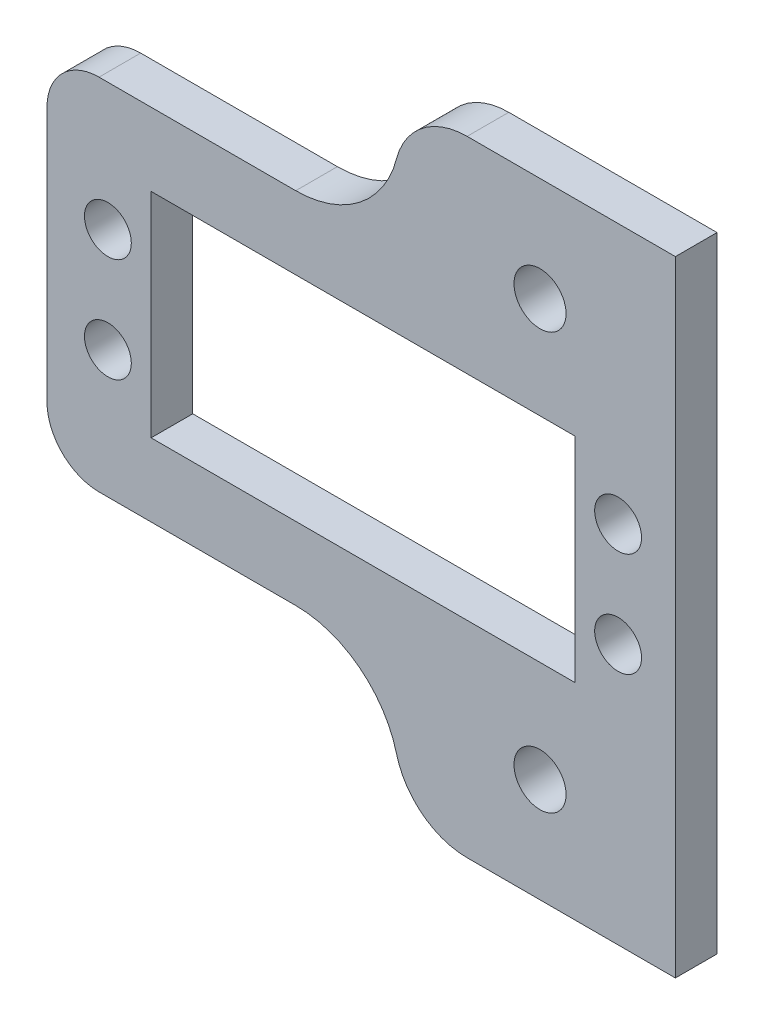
from build123d import *

# Parameters (mm, degrees)
SKETCH1_R           = 2.5
SKETCH1_R_2         = 2.25
SKETCH1_W           = 40.7
SKETCH1_H           = 20.5
BOSS_EXTRUDE1_DEPTH = 2


with BuildPart() as part:
    # Sketch1 → Boss-Extrude1 (new, symmetric)
    with BuildSketch(Plane.XY):
        with BuildLine():
            Line((30, -30), (30, 30))
            Line((30, 30), (10, 30))
            ThreePointArc((10, 30), (5.71339295, 28.533985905), (3.222279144, 24.75))
            ThreePointArc((3.222279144, 24.75), (-0.336454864, 19.34430585), (-6.460179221, 17.25))
            Line((-6.460179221, 17.25), (-25.35, 17.25))
            ThreePointArc((-25.35, 17.25), (-28.885533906, 15.785533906), (-30.35, 12.25))
            Line((-30.35, 12.25), (-30.35, -12.25))
            ThreePointArc((-30.35, -12.25), (-28.885533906, -15.785533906), (-25.35, -17.25))
            Line((-25.35, -17.25), (-6.460179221, -17.25))
            ThreePointArc((-6.460179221, -17.25), (-0.336454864, -19.34430585), (3.222279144, -24.75))
            ThreePointArc((3.222279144, -24.75), (5.71339295, -28.533985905), (10, -30))
            Line((10, -30), (30, -30))
        make_face()
        with Locations((17, 20)):
            Circle(SKETCH1_R, mode=Mode.SUBTRACT)
        with Locations((17, -20)):
            Circle(SKETCH1_R, mode=Mode.SUBTRACT)
        with Locations((-24.5, -5)):
            Circle(SKETCH1_R_2, mode=Mode.SUBTRACT)
        with Locations((24.5, -5)):
            Circle(SKETCH1_R_2, mode=Mode.SUBTRACT)
        with Locations((24.5, 5)):
            Circle(SKETCH1_R_2, mode=Mode.SUBTRACT)
        with Locations((-24.5, 5)):
            Circle(SKETCH1_R_2, mode=Mode.SUBTRACT)
        Rectangle(SKETCH1_W, SKETCH1_H, mode=Mode.SUBTRACT)
    extrude(amount=BOSS_EXTRUDE1_DEPTH, both=True)


solid = part.part
